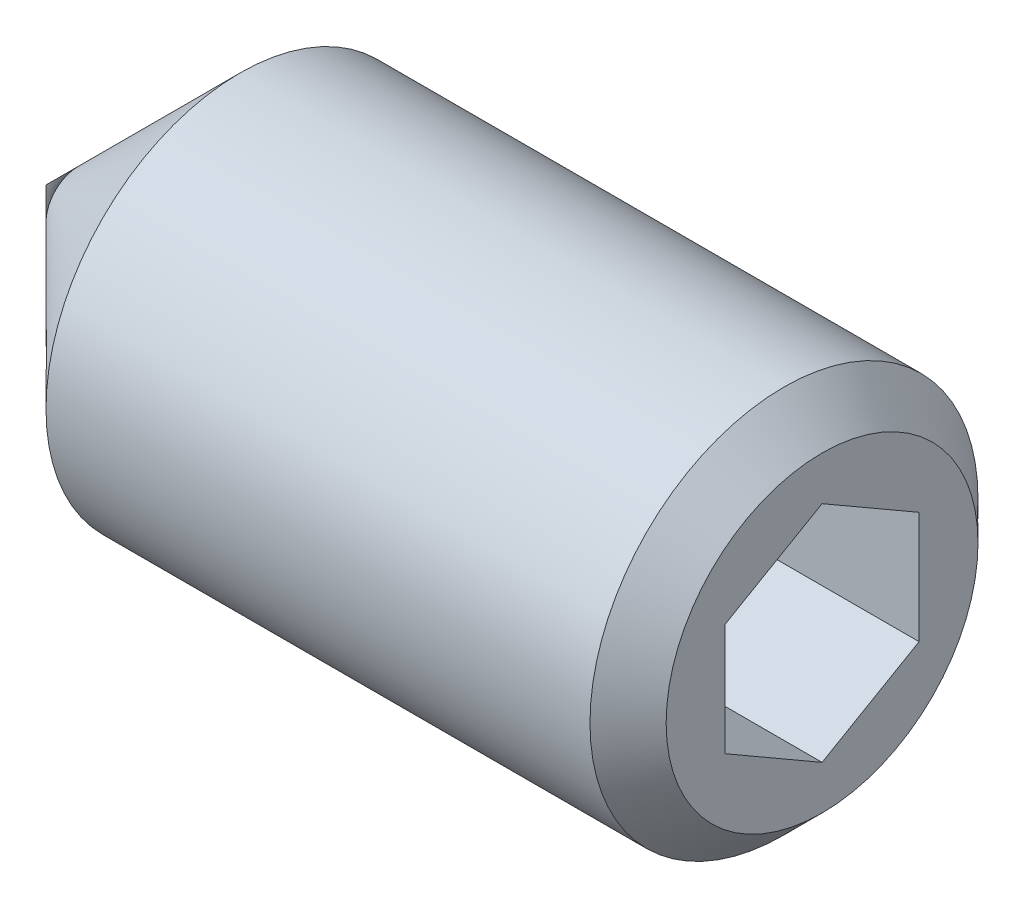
ISO-10303-21;
HEADER;
FILE_DESCRIPTION(('STEP AP214'),'2;1');
FILE_NAME('part.step','',(''),(''),'','','');
FILE_SCHEMA(('AUTOMOTIVE_DESIGN { 1 0 10303 214 1 1 1 1 }'));
ENDSEC;
DATA;
#1=APPLICATION_CONTEXT('core data for automotive mechanical design processes');
#2=APPLICATION_PROTOCOL_DEFINITION('international standard','automotive_design',2000,#1);
#3=PRODUCT_CONTEXT('',#1,'mechanical');
#4=PRODUCT('Part','Part','',(#3));
#5=PRODUCT_RELATED_PRODUCT_CATEGORY('part','',(#4));
#6=PRODUCT_DEFINITION_FORMATION('','',#4);
#7=PRODUCT_DEFINITION_CONTEXT('part definition',#1,'design');
#8=PRODUCT_DEFINITION('design','',#6,#7);
#9=PRODUCT_DEFINITION_SHAPE('','',#8);
#10=(LENGTH_UNIT() NAMED_UNIT(*) SI_UNIT(.MILLI.,.METRE.));
#11=(NAMED_UNIT(*) PLANE_ANGLE_UNIT() SI_UNIT($,.RADIAN.));
#12=(NAMED_UNIT(*) SI_UNIT($,.STERADIAN.) SOLID_ANGLE_UNIT());
#13=UNCERTAINTY_MEASURE_WITH_UNIT(LENGTH_MEASURE(1.E-05),#10,'distance_accuracy_value','');
#14=(GEOMETRIC_REPRESENTATION_CONTEXT(3) GLOBAL_UNCERTAINTY_ASSIGNED_CONTEXT((#13)) GLOBAL_UNIT_ASSIGNED_CONTEXT((#10,
#11,#12)) REPRESENTATION_CONTEXT('',''));
#15=CARTESIAN_POINT('',(0.,0.,0.));
#16=DIRECTION('',(0.,0.,1.));
#17=DIRECTION('',(1.,0.,0.));
#18=AXIS2_PLACEMENT_3D('',#15,#16,#17);
#19=CARTESIAN_POINT('',(9.99999999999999,-0.721687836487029,-1.25));
#20=DIRECTION('',(0.,0.,-1.));
#21=DIRECTION('',(-1.,0.,0.));
#22=AXIS2_PLACEMENT_3D('',#19,#20,#21);
#23=PLANE('',#22);
#24=DIRECTION('',(1.,0.,0.));
#25=VECTOR('',#24,1.);
#26=CARTESIAN_POINT('',(9.99999999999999,-0.721687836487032,-1.24999999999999));
#27=LINE('',#26,#25);
#28=CARTESIAN_POINT('',(7.00000000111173,-0.721687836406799,-1.24999999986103));
#29=VERTEX_POINT('',#28);
#30=CARTESIAN_POINT('',(9.99999999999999,-0.721687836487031,-1.24999999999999));
#31=VERTEX_POINT('',#30);
#32=EDGE_CURVE('E76',#29,#31,#27,.T.);
#33=ORIENTED_EDGE('',*,*,#32,.T.);
#34=DIRECTION('',(0.,1.,0.));
#35=VECTOR('',#34,1.);
#36=CARTESIAN_POINT('',(9.99999999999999,-0.721687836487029,-1.25));
#37=LINE('',#36,#35);
#38=CARTESIAN_POINT('',(9.99999999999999,0.721687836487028,-1.24999999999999));
#39=VERTEX_POINT('',#38);
#40=EDGE_CURVE('E82',#39,#31,#37,.F.);
#41=ORIENTED_EDGE('',*,*,#40,.F.);
#42=DIRECTION('',(1.,0.,0.));
#43=VECTOR('',#42,1.);
#44=CARTESIAN_POINT('',(9.99999999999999,0.721687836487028,-1.24999999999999));
#45=LINE('',#44,#43);
#46=CARTESIAN_POINT('',(7.00000000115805,0.721687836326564,-1.25));
#47=VERTEX_POINT('',#46);
#48=EDGE_CURVE('E79',#39,#47,#45,.F.);
#49=ORIENTED_EDGE('',*,*,#48,.T.);
#50=CARTESIAN_POINT('',(7.00000000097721,-0.721687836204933,-1.25000000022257));
#51=CARTESIAN_POINT('',(6.9816847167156,-0.658260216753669,-1.25000000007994));
#52=CARTESIAN_POINT('',(6.96502792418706,-0.594285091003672,-1.25000000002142));
#53=CARTESIAN_POINT('',(6.93595399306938,-0.465227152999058,-1.24999999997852));
#54=CARTESIAN_POINT('',(6.92354713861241,-0.400142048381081,-1.24999999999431));
#55=CARTESIAN_POINT('',(6.90423497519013,-0.270778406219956,-1.25000000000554));
#56=CARTESIAN_POINT('',(6.89720111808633,-0.206519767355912,-1.25000000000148));
#57=CARTESIAN_POINT('',(6.88880573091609,-0.0777002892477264,-1.24999999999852));
#58=CARTESIAN_POINT('',(6.88743724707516,-0.0131399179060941,-1.24999999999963));
#59=CARTESIAN_POINT('',(6.89029143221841,0.107484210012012,-1.25000000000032));
#60=CARTESIAN_POINT('',(6.89381330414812,0.163566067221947,-1.25000000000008));
#61=CARTESIAN_POINT('',(6.90497331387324,0.275364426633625,-1.24999999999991));
#62=CARTESIAN_POINT('',(6.912615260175,0.331080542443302,-1.24999999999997));
#63=CARTESIAN_POINT('',(6.93171864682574,0.443109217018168,-1.25000000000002));
#64=CARTESIAN_POINT('',(6.94326102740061,0.49940760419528,-1.25000000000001));
#65=CARTESIAN_POINT('',(6.96945735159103,0.61116493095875,-1.24999999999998));
#66=CARTESIAN_POINT('',(6.98410514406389,0.666625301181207,-1.24999999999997));
#67=CARTESIAN_POINT('',(7.00000000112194,0.721687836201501,-1.25));
#68=B_SPLINE_CURVE_WITH_KNOTS('',3,(#50,#51,#52,#53,#54,#55,#56,#57,#58,#59,#60,#61,#62,#63,#64,
#65,#66,#67),.UNSPECIFIED.,.F.,.F.,(4,2,2,2,2,2,2,2,4),(0.,0.198135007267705,0.396746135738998,
0.590442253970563,0.783900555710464,0.952317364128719,1.12089012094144,1.29320101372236,
1.46517373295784),.UNSPECIFIED.);
#69=EDGE_CURVE('E19',#29,#47,#68,.T.);
#70=ORIENTED_EDGE('',*,*,#69,.F.);
#71=EDGE_LOOP('',(#33,#41,#49,#70));
#72=FACE_BOUND('',#71,.T.);
#73=ADVANCED_FACE('F15',(#72),#23,.F.);
#74=CARTESIAN_POINT('',(9.99999999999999,-1.44337567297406,0.));
#75=DIRECTION('',(0.,-0.866025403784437,-0.500000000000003));
#76=DIRECTION('',(0.,0.500000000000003,-0.866025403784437));
#77=AXIS2_PLACEMENT_3D('',#74,#75,#76);
#78=PLANE('',#77);
#79=DIRECTION('',(1.,0.,0.));
#80=VECTOR('',#79,1.);
#81=CARTESIAN_POINT('',(9.99999999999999,-1.44337567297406,0.));
#82=LINE('',#81,#80);
#83=CARTESIAN_POINT('',(7.00000000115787,-1.44337567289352,-1.39493570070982E-10));
#84=VERTEX_POINT('',#83);
#85=CARTESIAN_POINT('',(9.99999999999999,-1.44337567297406,0.));
#86=VERTEX_POINT('',#85);
#87=EDGE_CURVE('E143',#84,#86,#82,.T.);
#88=ORIENTED_EDGE('',*,*,#87,.T.);
#89=DIRECTION('',(0.,0.500000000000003,-0.866025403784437));
#90=VECTOR('',#89,1.);
#91=CARTESIAN_POINT('',(9.99999999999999,-1.44337567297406,0.));
#92=LINE('',#91,#90);
#93=EDGE_CURVE('E92',#31,#86,#92,.F.);
#94=ORIENTED_EDGE('',*,*,#93,.F.);
#95=ORIENTED_EDGE('',*,*,#32,.F.);
#96=CARTESIAN_POINT('',(7.00000000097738,-1.44337567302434,-3.56351492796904E-10));
#97=CARTESIAN_POINT('',(6.98168471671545,-1.41166186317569,-0.0549299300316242));
#98=CARTESIAN_POINT('',(6.96502792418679,-1.37967430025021,-0.110334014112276));
#99=CARTESIAN_POINT('',(6.93595399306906,-1.31514533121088,-0.222101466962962));
#100=CARTESIAN_POINT('',(6.92354713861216,-1.2826027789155,-0.278466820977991));
#101=CARTESIAN_POINT('',(6.90423497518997,-1.21792095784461,-0.390499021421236));
#102=CARTESIAN_POINT('',(6.8972011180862,-1.18579163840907,-0.446148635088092));
#103=CARTESIAN_POINT('',(6.88880573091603,-1.12138189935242,-0.557709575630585));
#104=CARTESIAN_POINT('',(6.88743724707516,-1.08910171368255,-0.613620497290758));
#105=CARTESIAN_POINT('',(6.89029143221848,-1.02878964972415,-0.71808405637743));
#106=CARTESIAN_POINT('',(6.89381330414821,-1.00074872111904,-0.76665236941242));
#107=CARTESIAN_POINT('',(6.90497331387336,-0.944849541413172,-0.863472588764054));
#108=CARTESIAN_POINT('',(6.91261526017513,-0.91699148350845,-0.911724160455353));
#109=CARTESIAN_POINT('',(6.93171864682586,-0.860977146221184,-1.0087438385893));
#110=CARTESIAN_POINT('',(6.94326102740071,-0.832827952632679,-1.05749967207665));
#111=CARTESIAN_POINT('',(6.9694573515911,-0.776949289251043,-1.15428435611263));
#112=CARTESIAN_POINT('',(6.98410514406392,-0.749219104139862,-1.20231444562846));
#113=CARTESIAN_POINT('',(7.00000000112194,-0.721687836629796,-1.24999999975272));
#114=B_SPLINE_CURVE_WITH_KNOTS('',3,(#96,#97,#98,#99,#100,#101,#102,#103,#104,#105,#106,#107,
#108,#109,#110,#111,#112,#113),.UNSPECIFIED.,.F.,.F.,(4,2,2,2,2,2,2,2,4),(0.,0.198135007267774,
0.396746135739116,0.59044225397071,0.783900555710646,0.952317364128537,1.12089012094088,
1.29320101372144,1.46517373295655),.UNSPECIFIED.);
#115=EDGE_CURVE('E84',#84,#29,#114,.T.);
#116=ORIENTED_EDGE('',*,*,#115,.F.);
#117=EDGE_LOOP('',(#88,#94,#95,#116));
#118=FACE_BOUND('',#117,.T.);
#119=ADVANCED_FACE('F93',(#118),#78,.F.);
#120=CARTESIAN_POINT('',(9.99999999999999,0.721687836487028,-1.24999999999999));
#121=DIRECTION('',(0.,0.86602540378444,-0.499999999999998));
#122=DIRECTION('',(0.,0.499999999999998,0.86602540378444));
#123=AXIS2_PLACEMENT_3D('',#120,#121,#122);
#124=PLANE('',#123);
#125=ORIENTED_EDGE('',*,*,#48,.F.);
#126=DIRECTION('',(0.,0.499999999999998,0.86602540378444));
#127=VECTOR('',#126,1.);
#128=CARTESIAN_POINT('',(9.99999999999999,0.721687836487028,-1.24999999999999));
#129=LINE('',#128,#127);
#130=CARTESIAN_POINT('',(9.99999999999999,1.44337567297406,0.));
#131=VERTEX_POINT('',#130);
#132=EDGE_CURVE('E91',#131,#39,#129,.F.);
#133=ORIENTED_EDGE('',*,*,#132,.F.);
#134=DIRECTION('',(1.,0.,0.));
#135=VECTOR('',#134,1.);
#136=CARTESIAN_POINT('',(9.99999999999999,1.44337567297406,0.));
#137=LINE('',#136,#135);
#138=CARTESIAN_POINT('',(7.00000000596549,1.44337568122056,1.42833672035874E-08));
#139=VERTEX_POINT('',#138);
#140=EDGE_CURVE('E188',#131,#139,#137,.F.);
#141=ORIENTED_EDGE('',*,*,#140,.T.);
#142=CARTESIAN_POINT('',(7.00000000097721,0.721687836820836,-1.24999999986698));
#143=CARTESIAN_POINT('',(6.98168471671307,0.753401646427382,-1.1950700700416));
#144=CARTESIAN_POINT('',(6.96502792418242,0.785389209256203,-1.13966598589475));
#145=CARTESIAN_POINT('',(6.93595399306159,0.849918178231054,-1.02789853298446));
#146=CARTESIAN_POINT('',(6.92354713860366,0.882460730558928,-0.971533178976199));
#147=CARTESIAN_POINT('',(6.90423497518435,0.947142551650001,-0.859500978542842));
#148=CARTESIAN_POINT('',(6.89720111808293,0.979271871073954,-0.803851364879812));
#149=CARTESIAN_POINT('',(6.88880573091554,1.04368161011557,-0.692290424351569));
#150=CARTESIAN_POINT('',(6.88743724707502,1.07596179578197,-0.636379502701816));
#151=CARTESIAN_POINT('',(6.89029143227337,1.13627386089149,-0.531915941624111));
#152=CARTESIAN_POINT('',(6.89381330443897,1.16431479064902,-0.483347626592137));
#153=CARTESIAN_POINT('',(6.9049733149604,1.22021397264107,-0.386527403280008));
#154=CARTESIAN_POINT('',(6.91261526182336,1.24807203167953,-0.338275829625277));
#155=CARTESIAN_POINT('',(6.93171864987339,1.30408637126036,-0.24125614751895));
#156=CARTESIAN_POINT('',(6.94326103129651,1.33223556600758,-0.19250031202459));
#157=CARTESIAN_POINT('',(6.96945735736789,1.38811423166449,-0.0957156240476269));
#158=CARTESIAN_POINT('',(6.98410515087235,1.41584441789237,-0.0476855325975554));
#159=CARTESIAN_POINT('',(7.00000000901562,1.44337568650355,2.34337814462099E-08));
#160=B_SPLINE_CURVE_WITH_KNOTS('',3,(#142,#143,#144,#145,#146,#147,#148,#149,#150,#151,#152,
#153,#154,#155,#156,#157,#158,#159),.UNSPECIFIED.,.F.,.F.,(4,2,2,2,2,2,2,2,4),(0.,
0.19813500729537,0.396746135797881,0.590442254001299,0.783900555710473,0.952317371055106,
1.12089013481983,1.29320103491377,1.46517376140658),.UNSPECIFIED.);
#161=EDGE_CURVE('E138',#47,#139,#160,.T.);
#162=ORIENTED_EDGE('',*,*,#161,.F.);
#163=EDGE_LOOP('',(#125,#133,#141,#162));
#164=FACE_BOUND('',#163,.T.);
#165=ADVANCED_FACE('F144',(#164),#124,.F.);
#166=CARTESIAN_POINT('',(9.99999999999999,-0.721687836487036,1.24999999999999));
#167=DIRECTION('',(0.,-0.86602540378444,0.499999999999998));
#168=DIRECTION('',(0.,-0.499999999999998,-0.86602540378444));
#169=AXIS2_PLACEMENT_3D('',#166,#167,#168);
#170=PLANE('',#169);
#171=DIRECTION('',(1.,0.,0.));
#172=VECTOR('',#171,1.);
#173=CARTESIAN_POINT('',(9.99999999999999,-0.721687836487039,1.25));
#174=LINE('',#173,#172);
#175=CARTESIAN_POINT('',(6.99999999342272,-0.721687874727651,1.24999996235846));
#176=VERTEX_POINT('',#175);
#177=CARTESIAN_POINT('',(9.99999999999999,-0.721687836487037,1.25));
#178=VERTEX_POINT('',#177);
#179=EDGE_CURVE('E196',#176,#178,#174,.T.);
#180=ORIENTED_EDGE('',*,*,#179,.T.);
#181=DIRECTION('',(0.,-0.499999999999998,-0.86602540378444));
#182=VECTOR('',#181,1.);
#183=CARTESIAN_POINT('',(9.99999999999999,-0.721687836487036,1.24999999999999));
#184=LINE('',#183,#182);
#185=EDGE_CURVE('E189',#86,#178,#184,.F.);
#186=ORIENTED_EDGE('',*,*,#185,.F.);
#187=ORIENTED_EDGE('',*,*,#87,.F.);
#188=CARTESIAN_POINT('',(7.00000000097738,-1.44337567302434,3.56353658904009E-10));
#189=CARTESIAN_POINT('',(6.98168471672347,-1.41166186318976,0.0549299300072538));
#190=CARTESIAN_POINT('',(6.96502792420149,-1.37967430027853,0.110334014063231));
#191=CARTESIAN_POINT('',(6.93595399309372,-1.31514533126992,0.222101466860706));
#192=CARTESIAN_POINT('',(6.92354713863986,-1.28260277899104,0.278466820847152));
#193=CARTESIAN_POINT('',(6.90423497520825,-1.21792095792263,0.390499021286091));
#194=CARTESIAN_POINT('',(6.89720111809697,-1.18579163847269,0.446148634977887));
#195=CARTESIAN_POINT('',(6.88880573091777,-1.12138189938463,0.55770957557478));
#196=CARTESIAN_POINT('',(6.88743724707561,-1.08910171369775,0.613620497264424));
#197=CARTESIAN_POINT('',(6.89029143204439,-1.02878965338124,0.718084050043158));
#198=CARTESIAN_POINT('',(6.893813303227,-1.00074872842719,0.766652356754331));
#199=CARTESIAN_POINT('',(6.90497331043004,-0.944849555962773,0.863472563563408));
#200=CARTESIAN_POINT('',(6.91261525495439,-0.916991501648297,0.911724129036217));
#201=CARTESIAN_POINT('',(6.93171863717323,-0.86097717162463,1.00874379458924));
#202=CARTESIAN_POINT('',(6.94326101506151,-0.83282798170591,1.05749962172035));
#203=CARTESIAN_POINT('',(6.96945733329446,-0.776949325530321,1.15428429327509));
#204=CARTESIAN_POINT('',(6.98410512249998,-0.749219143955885,1.2023143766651));
#205=CARTESIAN_POINT('',(6.99999997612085,-0.721687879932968,1.24999992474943));
#206=B_SPLINE_CURVE_WITH_KNOTS('',3,(#188,#189,#190,#191,#192,#193,#194,#195,#196,#197,#198,
#199,#200,#201,#202,#203,#204,#205),.UNSPECIFIED.,.F.,.F.,(4,2,2,2,2,2,2,2,4),(0.,
0.198135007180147,0.396746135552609,0.590442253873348,0.783900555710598,0.95231734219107,
1.12089007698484,1.29320094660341,1.46517364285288),.UNSPECIFIED.);
#207=EDGE_CURVE('E87',#84,#176,#206,.T.);
#208=ORIENTED_EDGE('',*,*,#207,.T.);
#209=EDGE_LOOP('',(#180,#186,#187,#208));
#210=FACE_BOUND('',#209,.T.);
#211=ADVANCED_FACE('F147',(#210),#170,.F.);
#212=CARTESIAN_POINT('',(9.99999999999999,1.44337567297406,0.));
#213=DIRECTION('',(0.,0.866025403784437,0.500000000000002));
#214=DIRECTION('',(0.,-0.500000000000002,0.866025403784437));
#215=AXIS2_PLACEMENT_3D('',#212,#213,#214);
#216=PLANE('',#215);
#217=ORIENTED_EDGE('',*,*,#140,.F.);
#218=DIRECTION('',(0.,-0.500000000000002,0.866025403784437));
#219=VECTOR('',#218,1.);
#220=CARTESIAN_POINT('',(9.99999999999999,1.44337567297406,0.));
#221=LINE('',#220,#219);
#222=CARTESIAN_POINT('',(9.99999999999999,0.721687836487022,1.25));
#223=VERTEX_POINT('',#222);
#224=EDGE_CURVE('E179',#223,#131,#221,.F.);
#225=ORIENTED_EDGE('',*,*,#224,.F.);
#226=DIRECTION('',(1.,0.,0.));
#227=VECTOR('',#226,1.);
#228=CARTESIAN_POINT('',(9.99999999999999,0.721687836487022,1.25));
#229=LINE('',#228,#227);
#230=CARTESIAN_POINT('',(6.99999998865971,0.721687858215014,1.24999996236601));
#231=VERTEX_POINT('',#230);
#232=EDGE_CURVE('E110',#223,#231,#229,.F.);
#233=ORIENTED_EDGE('',*,*,#232,.T.);
#234=CARTESIAN_POINT('',(6.99999997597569,0.721687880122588,1.24999992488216));
#235=CARTESIAN_POINT('',(6.98168469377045,0.753401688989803,1.19506999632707));
#236=CARTESIAN_POINT('',(6.96502790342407,0.785389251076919,1.13966591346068));
#237=CARTESIAN_POINT('',(6.93595397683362,0.849918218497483,1.02789846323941));
#238=CARTESIAN_POINT('',(6.92354712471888,0.882460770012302,0.97153311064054));
#239=CARTESIAN_POINT('',(6.90423496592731,0.947142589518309,0.859500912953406));
#240=CARTESIAN_POINT('',(6.89720111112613,0.979271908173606,0.803851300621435));
#241=CARTESIAN_POINT('',(6.88880572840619,1.04368164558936,0.692290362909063));
#242=CARTESIAN_POINT('',(6.88743724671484,1.07596183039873,0.636379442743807));
#243=CARTESIAN_POINT('',(6.89029143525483,1.13627388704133,0.531915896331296));
#244=CARTESIAN_POINT('',(6.8938133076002,1.16431480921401,0.483347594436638));
#245=CARTESIAN_POINT('',(6.90497331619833,1.22021397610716,0.386527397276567));
#246=CARTESIAN_POINT('',(6.91261526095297,1.2480720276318,0.338275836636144));
#247=CARTESIAN_POINT('',(6.93171864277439,1.30408635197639,0.24125618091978));
#248=CARTESIAN_POINT('',(6.94326102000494,1.33223553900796,0.192500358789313));
#249=CARTESIAN_POINT('',(6.96945733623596,1.38811418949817,0.095715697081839));
#250=CARTESIAN_POINT('',(6.98410512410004,1.41584436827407,0.0476856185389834));
#251=CARTESIAN_POINT('',(6.99999997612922,1.44337562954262,7.52254590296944E-08));
#252=B_SPLINE_CURVE_WITH_KNOTS('',3,(#234,#235,#236,#237,#238,#239,#240,#241,#242,#243,#244,
#245,#246,#247,#248,#249,#250,#251),.UNSPECIFIED.,.F.,.F.,(4,2,2,2,2,2,2,2,4),(0.,
0.198135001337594,0.396746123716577,0.590442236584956,0.783900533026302,0.952317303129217,
1.12089002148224,1.29320087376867,1.46517355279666),.UNSPECIFIED.);
#253=EDGE_CURVE('E134',#231,#139,#252,.T.);
#254=ORIENTED_EDGE('',*,*,#253,.T.);
#255=EDGE_LOOP('',(#217,#225,#233,#254));
#256=FACE_BOUND('',#255,.T.);
#257=ADVANCED_FACE('F122',(#256),#216,.F.);
#258=CARTESIAN_POINT('',(7.00500000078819,0.,0.));
#259=DIRECTION('',(1.,0.,0.));
#260=DIRECTION('',(0.,0.,-1.));
#261=AXIS2_PLACEMENT_3D('',#258,#259,#260);
#262=CONICAL_SURFACE('',#261,1.45203592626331,1.04719754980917);
#263=CARTESIAN_POINT('',(6.16666666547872,-1.13686837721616E-10,0.));
#264=VERTEX_POINT('',#263);
#265=VERTEX_LOOP('',#264);
#266=FACE_BOUND('',#265,.T.);
#267=ORIENTED_EDGE('',*,*,#207,.F.);
#268=ORIENTED_EDGE('',*,*,#115,.T.);
#269=ORIENTED_EDGE('',*,*,#69,.T.);
#270=ORIENTED_EDGE('',*,*,#161,.T.);
#271=ORIENTED_EDGE('',*,*,#253,.F.);
#272=CARTESIAN_POINT('',(7.00000003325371,0.721687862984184,1.24999996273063));
#273=CARTESIAN_POINT('',(6.98168473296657,0.658260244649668,1.24999998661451));
#274=CARTESIAN_POINT('',(6.96502793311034,0.594285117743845,1.24999999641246));
#275=CARTESIAN_POINT('',(6.93595399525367,0.465227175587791,1.25000000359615));
#276=CARTESIAN_POINT('',(6.92354714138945,0.40014206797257,1.25000000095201));
#277=CARTESIAN_POINT('',(6.90423497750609,0.270778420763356,1.24999999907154));
#278=CARTESIAN_POINT('',(6.89720111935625,0.206519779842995,1.2499999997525));
#279=CARTESIAN_POINT('',(6.88880573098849,0.0777002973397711,1.25000000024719));
#280=CARTESIAN_POINT('',(6.88743724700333,0.0131399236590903,1.25000000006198));
#281=CARTESIAN_POINT('',(6.89029143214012,-0.107484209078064,1.24999999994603));
#282=CARTESIAN_POINT('',(6.89381330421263,-0.163566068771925,1.24999999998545));
#283=CARTESIAN_POINT('',(6.90497331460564,-0.275364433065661,1.25000000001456));
#284=CARTESIAN_POINT('',(6.91261526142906,-0.331080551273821,1.2500000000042));
#285=CARTESIAN_POINT('',(6.93171864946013,-0.443109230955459,1.24999999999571));
#286=CARTESIAN_POINT('',(6.94326103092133,-0.49940762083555,1.24999999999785));
#287=CARTESIAN_POINT('',(6.96945735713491,-0.611164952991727,1.25000000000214));
#288=CARTESIAN_POINT('',(6.98410515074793,-0.666625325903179,1.25000000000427));
#289=CARTESIAN_POINT('',(7.000000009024,-0.72168786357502,1.25));
#290=B_SPLINE_CURVE_WITH_KNOTS('',3,(#272,#273,#274,#275,#276,#277,#278,#279,#280,#281,#282,
#283,#284,#285,#286,#287,#288,#289),.UNSPECIFIED.,.F.,.F.,(4,2,2,2,2,2,2,2,4),(0.,
0.198135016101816,0.396746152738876,0.590442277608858,0.783900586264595,0.95231740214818,
1.12089016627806,1.29320106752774,1.46517379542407),.UNSPECIFIED.);
#291=EDGE_CURVE('E104',#231,#176,#290,.T.);
#292=ORIENTED_EDGE('',*,*,#291,.T.);
#293=EDGE_LOOP('',(#267,#268,#269,#270,#271,#292));
#294=FACE_BOUND('',#293,.T.);
#295=ADVANCED_FACE('F85',(#266,#294),#262,.F.);
#296=CARTESIAN_POINT('',(9.99999999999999,0.721687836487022,1.25));
#297=DIRECTION('',(0.,0.,1.));
#298=DIRECTION('',(1.,0.,0.));
#299=AXIS2_PLACEMENT_3D('',#296,#297,#298);
#300=PLANE('',#299);
#301=ORIENTED_EDGE('',*,*,#232,.F.);
#302=DIRECTION('',(0.,1.,0.));
#303=VECTOR('',#302,1.);
#304=CARTESIAN_POINT('',(9.99999999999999,0.,1.25));
#305=LINE('',#304,#303);
#306=EDGE_CURVE('E103',#223,#178,#305,.F.);
#307=ORIENTED_EDGE('',*,*,#306,.T.);
#308=ORIENTED_EDGE('',*,*,#179,.F.);
#309=ORIENTED_EDGE('',*,*,#291,.F.);
#310=EDGE_LOOP('',(#301,#307,#308,#309));
#311=FACE_BOUND('',#310,.T.);
#312=ADVANCED_FACE('F116',(#311),#300,.F.);
#313=CARTESIAN_POINT('',(9.99999999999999,0.,0.));
#314=DIRECTION('',(-1.,0.,0.));
#315=DIRECTION('',(0.,0.,1.));
#316=AXIS2_PLACEMENT_3D('',#313,#314,#315);
#317=PLANE('',#316);
#318=ORIENTED_EDGE('',*,*,#224,.T.);
#319=ORIENTED_EDGE('',*,*,#132,.T.);
#320=ORIENTED_EDGE('',*,*,#40,.T.);
#321=ORIENTED_EDGE('',*,*,#93,.T.);
#322=ORIENTED_EDGE('',*,*,#185,.T.);
#323=ORIENTED_EDGE('',*,*,#306,.F.);
#324=EDGE_LOOP('',(#318,#319,#320,#321,#322,#323));
#325=FACE_BOUND('',#324,.T.);
#326=CARTESIAN_POINT('',(10.0000000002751,0.,0.));
#327=DIRECTION('',(-1.,0.,0.));
#328=DIRECTION('',(0.,0.,1.));
#329=AXIS2_PLACEMENT_3D('',#326,#327,#328);
#330=CIRCLE('',#329,2.00924000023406);
#331=CARTESIAN_POINT('',(10.0000000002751,0.,2.00924000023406));
#332=VERTEX_POINT('',#331);
#333=EDGE_CURVE('E100',#332,#332,#330,.T.);
#334=ORIENTED_EDGE('',*,*,#333,.F.);
#335=EDGE_LOOP('',(#334));
#336=FACE_BOUND('',#335,.T.);
#337=ADVANCED_FACE('F170',(#325,#336),#317,.F.);
#338=CARTESIAN_POINT('',(2.49999499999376,0.,0.));
#339=DIRECTION('',(1.,0.,0.));
#340=DIRECTION('',(0.,0.,-1.));
#341=AXIS2_PLACEMENT_3D('',#338,#339,#340);
#342=CONICAL_SURFACE('',#341,2.49999999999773,0.785399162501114);
#343=CARTESIAN_POINT('',(-4.43378667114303E-09,5.6843418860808E-11,0.));
#344=VERTEX_POINT('',#343);
#345=VERTEX_LOOP('',#344);
#346=FACE_BOUND('',#345,.T.);
#347=CARTESIAN_POINT('',(2.499995,0.,0.));
#348=DIRECTION('',(1.,0.,0.));
#349=DIRECTION('',(0.,1.,0.));
#350=AXIS2_PLACEMENT_3D('',#347,#348,#349);
#351=CIRCLE('',#350,2.5);
#352=CARTESIAN_POINT('',(2.499995,2.5,0.));
#353=VERTEX_POINT('',#352);
#354=EDGE_CURVE('E29',#353,#353,#351,.T.);
#355=ORIENTED_EDGE('',*,*,#354,.F.);
#356=EDGE_LOOP('',(#355));
#357=FACE_BOUND('',#356,.T.);
#358=ADVANCED_FACE('F164',(#346,#357),#342,.T.);
#359=CARTESIAN_POINT('',(9.50923999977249,0.,0.));
#360=DIRECTION('',(-1.,0.,0.));
#361=DIRECTION('',(0.,0.,1.));
#362=AXIS2_PLACEMENT_3D('',#359,#360,#361);
#363=CONICAL_SURFACE('',#362,2.4999999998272,0.78539816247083);
#364=ORIENTED_EDGE('',*,*,#333,.T.);
#365=EDGE_LOOP('',(#364));
#366=FACE_BOUND('',#365,.T.);
#367=CARTESIAN_POINT('',(9.50923999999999,0.,0.));
#368=DIRECTION('',(1.,0.,0.));
#369=DIRECTION('',(0.,1.,0.));
#370=AXIS2_PLACEMENT_3D('',#367,#368,#369);
#371=CIRCLE('',#370,2.5);
#372=CARTESIAN_POINT('',(9.50923999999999,2.5,0.));
#373=VERTEX_POINT('',#372);
#374=EDGE_CURVE('E10',#373,#373,#371,.F.);
#375=ORIENTED_EDGE('',*,*,#374,.F.);
#376=EDGE_LOOP('',(#375));
#377=FACE_BOUND('',#376,.T.);
#378=ADVANCED_FACE('F158',(#366,#377),#363,.T.);
#379=CARTESIAN_POINT('',(5.,0.,0.));
#380=DIRECTION('',(1.,0.,0.));
#381=DIRECTION('',(0.,1.,0.));
#382=AXIS2_PLACEMENT_3D('',#379,#380,#381);
#383=CYLINDRICAL_SURFACE('',#382,2.5);
#384=ORIENTED_EDGE('',*,*,#374,.T.);
#385=EDGE_LOOP('',(#384));
#386=FACE_BOUND('',#385,.T.);
#387=ORIENTED_EDGE('',*,*,#354,.T.);
#388=EDGE_LOOP('',(#387));
#389=FACE_BOUND('',#388,.T.);
#390=ADVANCED_FACE('F156',(#386,#389),#383,.T.);
#391=CLOSED_SHELL('',(#73,#119,#165,#211,#257,#295,#312,#337,#358,#378,#390));
#392=MANIFOLD_SOLID_BREP('B1',#391);
#393=ADVANCED_BREP_SHAPE_REPRESENTATION('',(#18,#392),#14);
#394=SHAPE_DEFINITION_REPRESENTATION(#9,#393);
ENDSEC;
END-ISO-10303-21;
